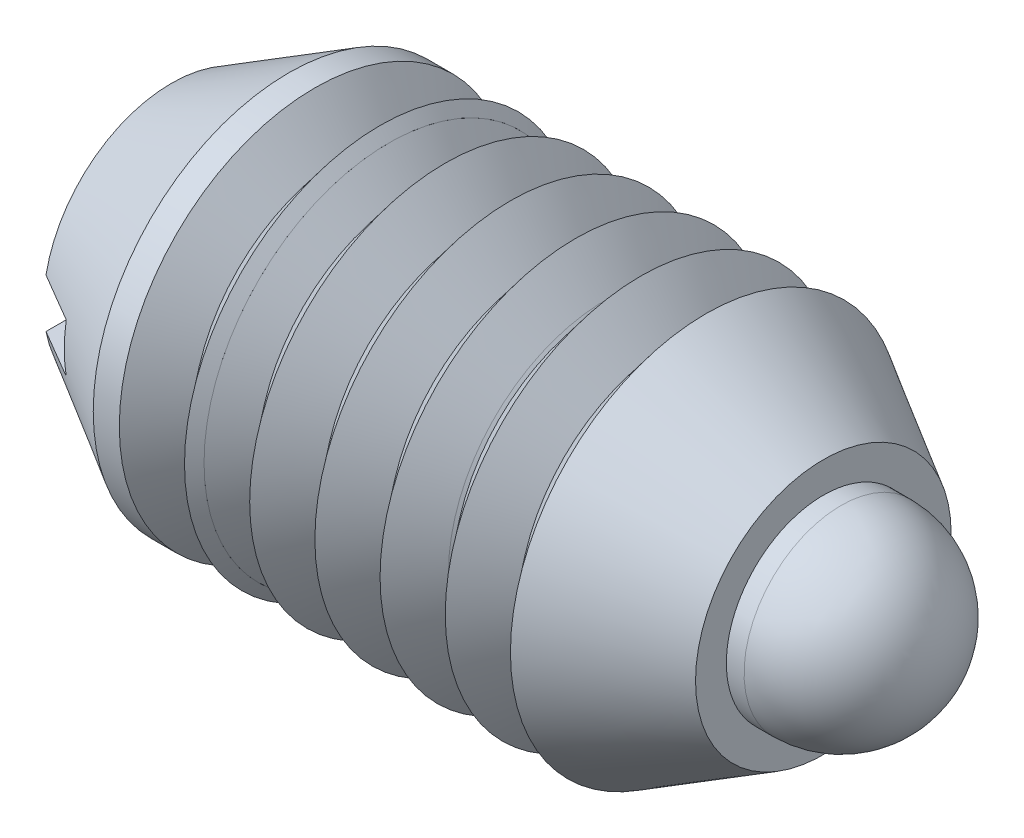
ISO-10303-21;
HEADER;
FILE_DESCRIPTION(('STEP AP214'),'2;1');
FILE_NAME('part.step','',(''),(''),'','','');
FILE_SCHEMA(('AUTOMOTIVE_DESIGN { 1 0 10303 214 1 1 1 1 }'));
ENDSEC;
DATA;
#1=APPLICATION_CONTEXT('core data for automotive mechanical design processes');
#2=APPLICATION_PROTOCOL_DEFINITION('international standard','automotive_design',2000,#1);
#3=PRODUCT_CONTEXT('',#1,'mechanical');
#4=PRODUCT('Part','Part','',(#3));
#5=PRODUCT_RELATED_PRODUCT_CATEGORY('part','',(#4));
#6=PRODUCT_DEFINITION_FORMATION('','',#4);
#7=PRODUCT_DEFINITION_CONTEXT('part definition',#1,'design');
#8=PRODUCT_DEFINITION('design','',#6,#7);
#9=PRODUCT_DEFINITION_SHAPE('','',#8);
#10=(LENGTH_UNIT() NAMED_UNIT(*) SI_UNIT(.MILLI.,.METRE.));
#11=(NAMED_UNIT(*) PLANE_ANGLE_UNIT() SI_UNIT($,.RADIAN.));
#12=(NAMED_UNIT(*) SI_UNIT($,.STERADIAN.) SOLID_ANGLE_UNIT());
#13=UNCERTAINTY_MEASURE_WITH_UNIT(LENGTH_MEASURE(1.E-05),#10,'distance_accuracy_value','');
#14=(GEOMETRIC_REPRESENTATION_CONTEXT(3) GLOBAL_UNCERTAINTY_ASSIGNED_CONTEXT((#13)) GLOBAL_UNIT_ASSIGNED_CONTEXT((#10,
#11,#12)) REPRESENTATION_CONTEXT('',''));
#15=CARTESIAN_POINT('',(0.,0.,0.));
#16=DIRECTION('',(0.,0.,1.));
#17=DIRECTION('',(1.,0.,0.));
#18=AXIS2_PLACEMENT_3D('',#15,#16,#17);
#19=CARTESIAN_POINT('',(10.44194,0.,0.));
#20=DIRECTION('',(-1.,0.,0.));
#21=DIRECTION('',(0.,-0.719424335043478,-0.694570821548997));
#22=AXIS2_PLACEMENT_3D('',#19,#20,#21);
#23=PLANE('',#22);
#24=CARTESIAN_POINT('',(10.44194,0.,0.));
#25=DIRECTION('',(1.,0.,0.));
#26=DIRECTION('',(0.,0.719424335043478,0.694570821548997));
#27=AXIS2_PLACEMENT_3D('',#24,#25,#26);
#28=CIRCLE('',#27,2.3622);
#29=CARTESIAN_POINT('',(10.44194,1.6994241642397,1.64071519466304));
#30=VERTEX_POINT('',#29);
#31=EDGE_CURVE('P0_E10',#30,#30,#28,.T.);
#32=ORIENTED_EDGE('',*,*,#31,.F.);
#33=EDGE_LOOP('',(#32));
#34=FACE_BOUND('',#33,.T.);
#35=ADVANCED_FACE('P0_F14',(#34),#23,.T.);
#36=CARTESIAN_POINT('',(10.91438,0.,0.));
#37=DIRECTION('',(1.,0.,0.));
#38=DIRECTION('',(0.,0.719424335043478,0.694570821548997));
#39=AXIS2_PLACEMENT_3D('',#36,#37,#38);
#40=CONICAL_SURFACE('',#39,2.83464,0.785398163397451);
#41=ORIENTED_EDGE('',*,*,#31,.T.);
#42=EDGE_LOOP('',(#41));
#43=FACE_BOUND('',#42,.T.);
#44=CARTESIAN_POINT('',(10.91438,0.,0.));
#45=DIRECTION('',(1.,0.,0.));
#46=DIRECTION('',(0.,0.719424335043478,0.694570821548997));
#47=AXIS2_PLACEMENT_3D('',#44,#45,#46);
#48=CIRCLE('',#47,2.83464);
#49=CARTESIAN_POINT('',(10.91438,2.03930899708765,1.96885823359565));
#50=VERTEX_POINT('',#49);
#51=EDGE_CURVE('P0_E20',#50,#50,#48,.T.);
#52=ORIENTED_EDGE('',*,*,#51,.F.);
#53=EDGE_LOOP('',(#52));
#54=FACE_BOUND('',#53,.T.);
#55=ADVANCED_FACE('P0_F54',(#43,#54),#40,.T.);
#56=CARTESIAN_POINT('',(18.669,0.,0.));
#57=DIRECTION('',(1.,0.,0.));
#58=DIRECTION('',(0.,0.719424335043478,0.694570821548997));
#59=AXIS2_PLACEMENT_3D('',#56,#57,#58);
#60=CYLINDRICAL_SURFACE('',#59,2.83464);
#61=ORIENTED_EDGE('',*,*,#51,.T.);
#62=EDGE_LOOP('',(#61));
#63=FACE_BOUND('',#62,.T.);
#64=CARTESIAN_POINT('',(14.3480499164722,0.,0.));
#65=DIRECTION('',(1.,0.,0.));
#66=DIRECTION('',(0.,0.719424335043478,0.694570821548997));
#67=AXIS2_PLACEMENT_3D('',#64,#65,#66);
#68=CIRCLE('',#67,2.83464);
#69=CARTESIAN_POINT('',(14.3480499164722,2.03930899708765,1.96885823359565));
#70=VERTEX_POINT('',#69);
#71=EDGE_CURVE('P0_E24',#70,#70,#68,.T.);
#72=ORIENTED_EDGE('',*,*,#71,.F.);
#73=EDGE_LOOP('',(#72));
#74=FACE_BOUND('',#73,.T.);
#75=ADVANCED_FACE('P0_F50',(#63,#74),#60,.T.);
#76=CARTESIAN_POINT('',(15.16634,0.,0.));
#77=DIRECTION('',(-1.,0.,0.));
#78=DIRECTION('',(0.,-0.719424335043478,-0.694570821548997));
#79=AXIS2_PLACEMENT_3D('',#76,#77,#78);
#80=CONICAL_SURFACE('',#79,2.3622,0.5235987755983);
#81=ORIENTED_EDGE('',*,*,#71,.T.);
#82=EDGE_LOOP('',(#81));
#83=FACE_BOUND('',#82,.T.);
#84=CARTESIAN_POINT('',(15.16634,0.,0.));
#85=DIRECTION('',(1.,0.,0.));
#86=DIRECTION('',(0.,0.719424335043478,0.694570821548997));
#87=AXIS2_PLACEMENT_3D('',#84,#85,#86);
#88=CIRCLE('',#87,2.3622);
#89=CARTESIAN_POINT('',(15.16634,1.6994241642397,1.64071519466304));
#90=VERTEX_POINT('',#89);
#91=EDGE_CURVE('P0_E28',#90,#90,#88,.T.);
#92=ORIENTED_EDGE('',*,*,#91,.F.);
#93=EDGE_LOOP('',(#92));
#94=FACE_BOUND('',#93,.T.);
#95=ADVANCED_FACE('P0_F41',(#83,#94),#80,.T.);
#96=CARTESIAN_POINT('',(18.669,0.,0.));
#97=DIRECTION('',(1.,0.,0.));
#98=DIRECTION('',(0.,0.719424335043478,0.694570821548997));
#99=AXIS2_PLACEMENT_3D('',#96,#97,#98);
#100=CYLINDRICAL_SURFACE('',#99,2.3622);
#101=ORIENTED_EDGE('',*,*,#91,.T.);
#102=EDGE_LOOP('',(#101));
#103=FACE_BOUND('',#102,.T.);
#104=CARTESIAN_POINT('',(16.3068,0.,0.));
#105=DIRECTION('',(1.,0.,0.));
#106=DIRECTION('',(0.,0.719424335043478,0.694570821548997));
#107=AXIS2_PLACEMENT_3D('',#104,#105,#106);
#108=CIRCLE('',#107,2.3622);
#109=CARTESIAN_POINT('',(16.3068,1.6994241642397,1.64071519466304));
#110=VERTEX_POINT('',#109);
#111=EDGE_CURVE('P0_E33',#110,#110,#108,.T.);
#112=ORIENTED_EDGE('',*,*,#111,.F.);
#113=EDGE_LOOP('',(#112));
#114=FACE_BOUND('',#113,.T.);
#115=ADVANCED_FACE('P0_F39',(#103,#114),#100,.T.);
#116=CARTESIAN_POINT('',(16.3068,0.,0.));
#117=DIRECTION('',(1.,0.,0.));
#118=DIRECTION('',(0.,0.719424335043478,0.694570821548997));
#119=AXIS2_PLACEMENT_3D('',#116,#117,#118);
#120=SPHERICAL_SURFACE('',#119,2.3622);
#121=ORIENTED_EDGE('',*,*,#111,.T.);
#122=EDGE_LOOP('',(#121));
#123=FACE_BOUND('',#122,.T.);
#124=ADVANCED_FACE('P0_F37',(#123),#120,.T.);
#125=CLOSED_SHELL('',(#35,#55,#75,#95,#115,#124));
#126=MANIFOLD_SOLID_BREP('P0_B1',#125);
#127=CARTESIAN_POINT('',(5.29166666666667,9.525,-4.7625));
#128=DIRECTION('',(-1.,0.,0.));
#129=DIRECTION('',(0.,-1.,0.));
#130=AXIS2_PLACEMENT_3D('',#127,#128,#129);
#131=PLANE('',#130);
#132=CARTESIAN_POINT('',(5.29166666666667,0.,0.));
#133=DIRECTION('',(-1.,0.,0.));
#134=DIRECTION('',(0.,-1.,0.));
#135=AXIS2_PLACEMENT_3D('',#132,#133,#134);
#136=CIRCLE('',#135,4.49812841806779);
#137=CARTESIAN_POINT('',(5.29166666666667,-4.49812841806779,0.));
#138=VERTEX_POINT('',#137);
#139=EDGE_CURVE('P1_E31',#138,#138,#136,.F.);
#140=ORIENTED_EDGE('',*,*,#139,.F.);
#141=EDGE_LOOP('',(#140));
#142=FACE_BOUND('',#141,.T.);
#143=CARTESIAN_POINT('',(5.29166666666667,0.,0.));
#144=DIRECTION('',(1.,0.,0.));
#145=DIRECTION('',(0.,0.,-1.));
#146=AXIS2_PLACEMENT_3D('',#143,#144,#145);
#147=CIRCLE('',#146,2.86004);
#148=CARTESIAN_POINT('',(5.29166666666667,0.,-2.86004));
#149=VERTEX_POINT('',#148);
#150=EDGE_CURVE('P1_E47',#149,#149,#147,.T.);
#151=ORIENTED_EDGE('',*,*,#150,.T.);
#152=EDGE_LOOP('',(#151));
#153=FACE_BOUND('',#152,.T.);
#154=ADVANCED_FACE('P1_F14',(#142,#153),#131,.T.);
#155=CARTESIAN_POINT('',(10.5833333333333,9.525,-4.7625));
#156=DIRECTION('',(1.,0.,0.));
#157=DIRECTION('',(0.,0.,-1.));
#158=AXIS2_PLACEMENT_3D('',#155,#156,#157);
#159=PLANE('',#158);
#160=CARTESIAN_POINT('',(10.5833333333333,0.,0.));
#161=DIRECTION('',(1.,0.,0.));
#162=DIRECTION('',(0.,0.,-1.));
#163=AXIS2_PLACEMENT_3D('',#160,#161,#162);
#164=CIRCLE('',#163,3.83719946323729);
#165=CARTESIAN_POINT('',(10.5833333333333,0.,-3.83719946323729));
#166=VERTEX_POINT('',#165);
#167=EDGE_CURVE('P1_E33',#166,#166,#164,.F.);
#168=ORIENTED_EDGE('',*,*,#167,.F.);
#169=EDGE_LOOP('',(#168));
#170=FACE_BOUND('',#169,.T.);
#171=CARTESIAN_POINT('',(10.5833333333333,0.,0.));
#172=DIRECTION('',(1.,0.,0.));
#173=DIRECTION('',(0.,0.,-1.));
#174=AXIS2_PLACEMENT_3D('',#171,#172,#173);
#175=CIRCLE('',#174,2.86004);
#176=CARTESIAN_POINT('',(10.5833333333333,0.,-2.86004));
#177=VERTEX_POINT('',#176);
#178=EDGE_CURVE('P1_E18',#177,#177,#175,.F.);
#179=ORIENTED_EDGE('',*,*,#178,.T.);
#180=EDGE_LOOP('',(#179));
#181=FACE_BOUND('',#180,.T.);
#182=ADVANCED_FACE('P1_F71',(#170,#181),#159,.T.);
#183=CARTESIAN_POINT('',(8.25499999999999,0.,0.));
#184=DIRECTION('',(-1.,0.,0.));
#185=DIRECTION('',(0.,0.,1.));
#186=AXIS2_PLACEMENT_3D('',#183,#184,#185);
#187=CONICAL_SURFACE('',#186,4.7625,0.895664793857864);
#188=CARTESIAN_POINT('',(9.04874999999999,0.,0.));
#189=DIRECTION('',(-1.,0.,0.));
#190=DIRECTION('',(0.,0.,1.));
#191=AXIS2_PLACEMENT_3D('',#188,#189,#190);
#192=CIRCLE('',#191,3.77110656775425);
#193=CARTESIAN_POINT('',(9.04874999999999,0.,3.77110656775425));
#194=VERTEX_POINT('',#193);
#195=EDGE_CURVE('P1_E10',#194,#194,#192,.T.);
#196=ORIENTED_EDGE('',*,*,#195,.T.);
#197=EDGE_LOOP('',(#196));
#198=FACE_BOUND('',#197,.T.);
#199=CARTESIAN_POINT('',(8.25499999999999,0.,0.));
#200=DIRECTION('',(-1.,0.,0.));
#201=DIRECTION('',(0.,0.,1.));
#202=AXIS2_PLACEMENT_3D('',#199,#200,#201);
#203=CIRCLE('',#202,4.7625);
#204=CARTESIAN_POINT('',(8.25499999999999,0.,4.7625));
#205=VERTEX_POINT('',#204);
#206=EDGE_CURVE('P1_E44',#205,#205,#203,.T.);
#207=ORIENTED_EDGE('',*,*,#206,.F.);
#208=EDGE_LOOP('',(#207));
#209=FACE_BOUND('',#208,.T.);
#210=ADVANCED_FACE('P1_F77',(#198,#209),#187,.T.);
#211=CARTESIAN_POINT('',(9.04874999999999,0.,0.));
#212=DIRECTION('',(1.,0.,0.));
#213=DIRECTION('',(0.,0.,-1.));
#214=AXIS2_PLACEMENT_3D('',#211,#212,#213);
#215=CONICAL_SURFACE('',#214,3.77110656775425,0.895664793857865);
#216=CARTESIAN_POINT('',(9.84249999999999,0.,0.));
#217=DIRECTION('',(-1.,0.,0.));
#218=DIRECTION('',(0.,0.,1.));
#219=AXIS2_PLACEMENT_3D('',#216,#217,#218);
#220=CIRCLE('',#219,4.7625);
#221=CARTESIAN_POINT('',(9.84249999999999,0.,4.7625));
#222=VERTEX_POINT('',#221);
#223=EDGE_CURVE('P1_E22',#222,#222,#220,.T.);
#224=ORIENTED_EDGE('',*,*,#223,.T.);
#225=EDGE_LOOP('',(#224));
#226=FACE_BOUND('',#225,.T.);
#227=ORIENTED_EDGE('',*,*,#195,.F.);
#228=EDGE_LOOP('',(#227));
#229=FACE_BOUND('',#228,.T.);
#230=ADVANCED_FACE('P1_F67',(#226,#229),#215,.T.);
#231=CARTESIAN_POINT('',(9.84249999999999,0.,0.));
#232=DIRECTION('',(-1.,0.,0.));
#233=DIRECTION('',(0.,0.,1.));
#234=AXIS2_PLACEMENT_3D('',#231,#232,#233);
#235=CONICAL_SURFACE('',#234,4.7625,0.895664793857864);
#236=ORIENTED_EDGE('',*,*,#223,.F.);
#237=EDGE_LOOP('',(#236));
#238=FACE_BOUND('',#237,.T.);
#239=ORIENTED_EDGE('',*,*,#167,.T.);
#240=EDGE_LOOP('',(#239));
#241=FACE_BOUND('',#240,.T.);
#242=ADVANCED_FACE('P1_F16',(#238,#241),#235,.T.);
#243=CARTESIAN_POINT('',(7.46124999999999,0.,0.));
#244=DIRECTION('',(1.,0.,0.));
#245=DIRECTION('',(0.,0.,-1.));
#246=AXIS2_PLACEMENT_3D('',#243,#244,#245);
#247=CONICAL_SURFACE('',#246,3.77110656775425,0.895664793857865);
#248=ORIENTED_EDGE('',*,*,#206,.T.);
#249=EDGE_LOOP('',(#248));
#250=FACE_BOUND('',#249,.T.);
#251=CARTESIAN_POINT('',(7.46124999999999,0.,0.));
#252=DIRECTION('',(-1.,0.,0.));
#253=DIRECTION('',(0.,0.,1.));
#254=AXIS2_PLACEMENT_3D('',#251,#252,#253);
#255=CIRCLE('',#254,3.77110656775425);
#256=CARTESIAN_POINT('',(7.46124999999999,0.,3.77110656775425));
#257=VERTEX_POINT('',#256);
#258=EDGE_CURVE('P1_E27',#257,#257,#255,.T.);
#259=ORIENTED_EDGE('',*,*,#258,.F.);
#260=EDGE_LOOP('',(#259));
#261=FACE_BOUND('',#260,.T.);
#262=ADVANCED_FACE('P1_F56',(#250,#261),#247,.T.);
#263=CARTESIAN_POINT('',(6.66749999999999,0.,0.));
#264=DIRECTION('',(-1.,0.,0.));
#265=DIRECTION('',(0.,0.,1.));
#266=AXIS2_PLACEMENT_3D('',#263,#264,#265);
#267=CONICAL_SURFACE('',#266,4.7625,0.895664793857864);
#268=ORIENTED_EDGE('',*,*,#258,.T.);
#269=EDGE_LOOP('',(#268));
#270=FACE_BOUND('',#269,.T.);
#271=CARTESIAN_POINT('',(6.66749999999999,0.,0.));
#272=DIRECTION('',(-1.,0.,0.));
#273=DIRECTION('',(0.,0.,1.));
#274=AXIS2_PLACEMENT_3D('',#271,#272,#273);
#275=CIRCLE('',#274,4.7625);
#276=CARTESIAN_POINT('',(6.66749999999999,0.,4.7625));
#277=VERTEX_POINT('',#276);
#278=EDGE_CURVE('P1_E35',#277,#277,#275,.T.);
#279=ORIENTED_EDGE('',*,*,#278,.F.);
#280=EDGE_LOOP('',(#279));
#281=FACE_BOUND('',#280,.T.);
#282=ADVANCED_FACE('P1_F53',(#270,#281),#267,.T.);
#283=CARTESIAN_POINT('',(5.87374999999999,0.,0.));
#284=DIRECTION('',(1.,0.,0.));
#285=DIRECTION('',(0.,0.,-1.));
#286=AXIS2_PLACEMENT_3D('',#283,#284,#285);
#287=CONICAL_SURFACE('',#286,3.77110656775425,0.895664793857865);
#288=ORIENTED_EDGE('',*,*,#278,.T.);
#289=EDGE_LOOP('',(#288));
#290=FACE_BOUND('',#289,.T.);
#291=CARTESIAN_POINT('',(5.87374999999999,0.,0.));
#292=DIRECTION('',(-1.,0.,0.));
#293=DIRECTION('',(0.,0.,1.));
#294=AXIS2_PLACEMENT_3D('',#291,#292,#293);
#295=CIRCLE('',#294,3.77110656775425);
#296=CARTESIAN_POINT('',(5.87374999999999,0.,3.77110656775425));
#297=VERTEX_POINT('',#296);
#298=EDGE_CURVE('P1_E39',#297,#297,#295,.T.);
#299=ORIENTED_EDGE('',*,*,#298,.F.);
#300=EDGE_LOOP('',(#299));
#301=FACE_BOUND('',#300,.T.);
#302=ADVANCED_FACE('P1_F65',(#290,#301),#287,.T.);
#303=CARTESIAN_POINT('',(5.07999999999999,0.,0.));
#304=DIRECTION('',(-1.,0.,0.));
#305=DIRECTION('',(0.,0.,1.));
#306=AXIS2_PLACEMENT_3D('',#303,#304,#305);
#307=CONICAL_SURFACE('',#306,4.7625,0.895664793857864);
#308=ORIENTED_EDGE('',*,*,#298,.T.);
#309=EDGE_LOOP('',(#308));
#310=FACE_BOUND('',#309,.T.);
#311=ORIENTED_EDGE('',*,*,#139,.T.);
#312=EDGE_LOOP('',(#311));
#313=FACE_BOUND('',#312,.T.);
#314=ADVANCED_FACE('P1_F84',(#310,#313),#307,.T.);
#315=CARTESIAN_POINT('',(15.875,0.,0.));
#316=DIRECTION('',(-1.,0.,0.));
#317=DIRECTION('',(0.,0.,1.));
#318=AXIS2_PLACEMENT_3D('',#315,#316,#317);
#319=CYLINDRICAL_SURFACE('',#318,2.86004);
#320=ORIENTED_EDGE('',*,*,#178,.F.);
#321=EDGE_LOOP('',(#320));
#322=FACE_BOUND('',#321,.T.);
#323=ORIENTED_EDGE('',*,*,#150,.F.);
#324=EDGE_LOOP('',(#323));
#325=FACE_BOUND('',#324,.T.);
#326=ADVANCED_FACE('P1_F87',(#322,#325),#319,.F.);
#327=CLOSED_SHELL('',(#154,#182,#210,#230,#242,#262,#282,#302,#314,#326));
#328=MANIFOLD_SOLID_BREP('P1_B1',#327);
#329=CARTESIAN_POINT('',(15.875,0.,0.));
#330=DIRECTION('',(1.,0.,0.));
#331=DIRECTION('',(0.,0.,-1.));
#332=AXIS2_PLACEMENT_3D('',#329,#330,#331);
#333=PLANE('',#332);
#334=CARTESIAN_POINT('',(15.875,0.,0.));
#335=DIRECTION('',(1.,0.,0.));
#336=DIRECTION('',(0.,0.,-1.));
#337=AXIS2_PLACEMENT_3D('',#334,#335,#336);
#338=CIRCLE('',#337,3.11272160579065);
#339=CARTESIAN_POINT('',(15.875,0.,-3.11272160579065));
#340=VERTEX_POINT('',#339);
#341=EDGE_CURVE('P2_E79',#340,#340,#338,.T.);
#342=ORIENTED_EDGE('',*,*,#341,.T.);
#343=EDGE_LOOP('',(#342));
#344=FACE_BOUND('',#343,.T.);
#345=CARTESIAN_POINT('',(15.875,0.,0.));
#346=DIRECTION('',(-1.,0.,0.));
#347=DIRECTION('',(0.,0.,1.));
#348=AXIS2_PLACEMENT_3D('',#345,#346,#347);
#349=CIRCLE('',#348,2.3622);
#350=CARTESIAN_POINT('',(15.875,0.,2.3622));
#351=VERTEX_POINT('',#350);
#352=EDGE_CURVE('P2_E66',#351,#351,#349,.T.);
#353=ORIENTED_EDGE('',*,*,#352,.T.);
#354=EDGE_LOOP('',(#353));
#355=FACE_BOUND('',#354,.T.);
#356=ADVANCED_FACE('P2_F15',(#344,#355),#333,.T.);
#357=CARTESIAN_POINT('',(15.875,0.,0.));
#358=DIRECTION('',(-1.,0.,0.));
#359=DIRECTION('',(0.,0.,1.));
#360=AXIS2_PLACEMENT_3D('',#357,#358,#359);
#361=CONICAL_SURFACE('',#360,3.11272160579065,0.523598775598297);
#362=CARTESIAN_POINT('',(13.0175,0.,0.));
#363=DIRECTION('',(-1.,0.,0.));
#364=DIRECTION('',(0.,0.,1.));
#365=AXIS2_PLACEMENT_3D('',#362,#363,#364);
#366=CIRCLE('',#365,4.7625);
#367=CARTESIAN_POINT('',(13.0175,0.,4.7625));
#368=VERTEX_POINT('',#367);
#369=EDGE_CURVE('P2_E139',#368,#368,#366,.T.);
#370=ORIENTED_EDGE('',*,*,#369,.F.);
#371=EDGE_LOOP('',(#370));
#372=FACE_BOUND('',#371,.T.);
#373=ORIENTED_EDGE('',*,*,#341,.F.);
#374=EDGE_LOOP('',(#373));
#375=FACE_BOUND('',#374,.T.);
#376=ADVANCED_FACE('P2_F17',(#372,#375),#361,.T.);
#377=CARTESIAN_POINT('',(0.,0.,0.));
#378=DIRECTION('',(-1.,0.,0.));
#379=DIRECTION('',(0.,0.,1.));
#380=AXIS2_PLACEMENT_3D('',#377,#378,#379);
#381=CYLINDRICAL_SURFACE('',#380,2.3622);
#382=CARTESIAN_POINT('',(15.16634,0.,0.));
#383=DIRECTION('',(-1.,0.,0.));
#384=DIRECTION('',(0.,0.,1.));
#385=AXIS2_PLACEMENT_3D('',#382,#383,#384);
#386=CIRCLE('',#385,2.3622);
#387=CARTESIAN_POINT('',(15.16634,0.,2.3622));
#388=VERTEX_POINT('',#387);
#389=EDGE_CURVE('P2_E151',#388,#388,#386,.T.);
#390=ORIENTED_EDGE('',*,*,#389,.T.);
#391=EDGE_LOOP('',(#390));
#392=FACE_BOUND('',#391,.T.);
#393=ORIENTED_EDGE('',*,*,#352,.F.);
#394=EDGE_LOOP('',(#393));
#395=FACE_BOUND('',#394,.T.);
#396=ADVANCED_FACE('P2_F177',(#392,#395),#381,.F.);
#397=CARTESIAN_POINT('',(15.16634,0.,0.));
#398=DIRECTION('',(-1.,0.,0.));
#399=DIRECTION('',(0.,0.,1.));
#400=AXIS2_PLACEMENT_3D('',#397,#398,#399);
#401=CONICAL_SURFACE('',#400,2.3622,0.785398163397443);
#402=CARTESIAN_POINT('',(14.6939,0.,0.));
#403=DIRECTION('',(-1.,0.,0.));
#404=DIRECTION('',(0.,0.,1.));
#405=AXIS2_PLACEMENT_3D('',#402,#403,#404);
#406=CIRCLE('',#405,2.83464);
#407=CARTESIAN_POINT('',(14.6939,0.,2.83464));
#408=VERTEX_POINT('',#407);
#409=EDGE_CURVE('P2_E148',#408,#408,#406,.T.);
#410=ORIENTED_EDGE('',*,*,#409,.T.);
#411=EDGE_LOOP('',(#410));
#412=FACE_BOUND('',#411,.T.);
#413=ORIENTED_EDGE('',*,*,#389,.F.);
#414=EDGE_LOOP('',(#413));
#415=FACE_BOUND('',#414,.T.);
#416=ADVANCED_FACE('P2_F184',(#412,#415),#401,.F.);
#417=CARTESIAN_POINT('',(0.,0.,0.));
#418=DIRECTION('',(-1.,0.,0.));
#419=DIRECTION('',(0.,0.,1.));
#420=AXIS2_PLACEMENT_3D('',#417,#418,#419);
#421=CYLINDRICAL_SURFACE('',#420,2.83464);
#422=CARTESIAN_POINT('',(3.571875,0.,0.));
#423=DIRECTION('',(-1.,0.,0.));
#424=DIRECTION('',(0.,0.,1.));
#425=AXIS2_PLACEMENT_3D('',#422,#423,#424);
#426=CIRCLE('',#425,2.83464);
#427=CARTESIAN_POINT('',(3.571875,0.,2.83464));
#428=VERTEX_POINT('',#427);
#429=EDGE_CURVE('P2_E145',#428,#428,#426,.T.);
#430=ORIENTED_EDGE('',*,*,#429,.T.);
#431=EDGE_LOOP('',(#430));
#432=FACE_BOUND('',#431,.T.);
#433=ORIENTED_EDGE('',*,*,#409,.F.);
#434=EDGE_LOOP('',(#433));
#435=FACE_BOUND('',#434,.T.);
#436=ADVANCED_FACE('P2_F189',(#432,#435),#421,.F.);
#437=CARTESIAN_POINT('',(3.571875,0.,0.));
#438=DIRECTION('',(1.,0.,0.));
#439=DIRECTION('',(0.,0.,-1.));
#440=AXIS2_PLACEMENT_3D('',#437,#438,#439);
#441=PLANE('',#440);
#442=ORIENTED_EDGE('',*,*,#429,.F.);
#443=EDGE_LOOP('',(#442));
#444=FACE_BOUND('',#443,.T.);
#445=ADVANCED_FACE('P2_F195',(#444),#441,.T.);
#446=CARTESIAN_POINT('',(12.22375,0.,0.));
#447=DIRECTION('',(1.,0.,0.));
#448=DIRECTION('',(0.,0.,-1.));
#449=AXIS2_PLACEMENT_3D('',#446,#447,#448);
#450=CONICAL_SURFACE('',#449,3.77110656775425,0.895664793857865);
#451=ORIENTED_EDGE('',*,*,#369,.T.);
#452=EDGE_LOOP('',(#451));
#453=FACE_BOUND('',#452,.T.);
#454=CARTESIAN_POINT('',(12.22375,0.,0.));
#455=DIRECTION('',(-1.,0.,0.));
#456=DIRECTION('',(0.,0.,1.));
#457=AXIS2_PLACEMENT_3D('',#454,#455,#456);
#458=CIRCLE('',#457,3.77110656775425);
#459=CARTESIAN_POINT('',(12.22375,0.,3.77110656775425));
#460=VERTEX_POINT('',#459);
#461=EDGE_CURVE('P2_E142',#460,#460,#458,.T.);
#462=ORIENTED_EDGE('',*,*,#461,.F.);
#463=EDGE_LOOP('',(#462));
#464=FACE_BOUND('',#463,.T.);
#465=ADVANCED_FACE('P2_F199',(#453,#464),#450,.T.);
#466=CARTESIAN_POINT('',(11.43,0.,0.));
#467=DIRECTION('',(-1.,0.,0.));
#468=DIRECTION('',(0.,0.,1.));
#469=AXIS2_PLACEMENT_3D('',#466,#467,#468);
#470=CONICAL_SURFACE('',#469,4.7625,0.895664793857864);
#471=ORIENTED_EDGE('',*,*,#461,.T.);
#472=EDGE_LOOP('',(#471));
#473=FACE_BOUND('',#472,.T.);
#474=CARTESIAN_POINT('',(11.43,0.,0.));
#475=DIRECTION('',(-1.,0.,0.));
#476=DIRECTION('',(0.,0.,1.));
#477=AXIS2_PLACEMENT_3D('',#474,#475,#476);
#478=CIRCLE('',#477,4.7625);
#479=CARTESIAN_POINT('',(11.43,0.,4.7625));
#480=VERTEX_POINT('',#479);
#481=EDGE_CURVE('P2_E133',#480,#480,#478,.T.);
#482=ORIENTED_EDGE('',*,*,#481,.F.);
#483=EDGE_LOOP('',(#482));
#484=FACE_BOUND('',#483,.T.);
#485=ADVANCED_FACE('P2_F203',(#473,#484),#470,.T.);
#486=CARTESIAN_POINT('',(10.63625,0.,0.));
#487=DIRECTION('',(1.,0.,0.));
#488=DIRECTION('',(0.,0.,-1.));
#489=AXIS2_PLACEMENT_3D('',#486,#487,#488);
#490=CONICAL_SURFACE('',#489,3.77110656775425,0.895664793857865);
#491=ORIENTED_EDGE('',*,*,#481,.T.);
#492=EDGE_LOOP('',(#491));
#493=FACE_BOUND('',#492,.T.);
#494=CARTESIAN_POINT('',(10.63625,0.,0.));
#495=DIRECTION('',(-1.,0.,0.));
#496=DIRECTION('',(0.,0.,1.));
#497=AXIS2_PLACEMENT_3D('',#494,#495,#496);
#498=CIRCLE('',#497,3.77110656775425);
#499=CARTESIAN_POINT('',(10.63625,0.,3.77110656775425));
#500=VERTEX_POINT('',#499);
#501=EDGE_CURVE('P2_E136',#500,#500,#498,.T.);
#502=ORIENTED_EDGE('',*,*,#501,.F.);
#503=EDGE_LOOP('',(#502));
#504=FACE_BOUND('',#503,.T.);
#505=ADVANCED_FACE('P2_F207',(#493,#504),#490,.T.);
#506=CARTESIAN_POINT('',(9.84249999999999,0.,0.));
#507=DIRECTION('',(-1.,0.,0.));
#508=DIRECTION('',(0.,0.,1.));
#509=AXIS2_PLACEMENT_3D('',#506,#507,#508);
#510=CONICAL_SURFACE('',#509,4.7625,0.895664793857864);
#511=CARTESIAN_POINT('',(10.5833333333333,0.,0.));
#512=DIRECTION('',(1.,0.,0.));
#513=DIRECTION('',(0.,0.,-1.));
#514=AXIS2_PLACEMENT_3D('',#511,#512,#513);
#515=CIRCLE('',#514,3.83719946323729);
#516=CARTESIAN_POINT('',(10.5833333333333,0.,-3.83719946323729));
#517=VERTEX_POINT('',#516);
#518=EDGE_CURVE('P2_E19',#517,#517,#515,.F.);
#519=ORIENTED_EDGE('',*,*,#518,.F.);
#520=EDGE_LOOP('',(#519));
#521=FACE_BOUND('',#520,.T.);
#522=ORIENTED_EDGE('',*,*,#501,.T.);
#523=EDGE_LOOP('',(#522));
#524=FACE_BOUND('',#523,.T.);
#525=ADVANCED_FACE('P2_F211',(#521,#524),#510,.T.);
#526=CARTESIAN_POINT('',(5.29166666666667,0.,0.));
#527=DIRECTION('',(1.,0.,0.));
#528=DIRECTION('',(0.,0.,-1.));
#529=AXIS2_PLACEMENT_3D('',#526,#527,#528);
#530=PLANE('',#529);
#531=CARTESIAN_POINT('',(5.29166666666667,0.,0.));
#532=DIRECTION('',(1.,0.,0.));
#533=DIRECTION('',(0.,0.,-1.));
#534=AXIS2_PLACEMENT_3D('',#531,#532,#533);
#535=CIRCLE('',#534,4.49812841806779);
#536=CARTESIAN_POINT('',(5.29166666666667,0.,-4.49812841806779));
#537=VERTEX_POINT('',#536);
#538=EDGE_CURVE('P2_E110',#537,#537,#535,.F.);
#539=ORIENTED_EDGE('',*,*,#538,.F.);
#540=EDGE_LOOP('',(#539));
#541=FACE_BOUND('',#540,.T.);
#542=CARTESIAN_POINT('',(5.29166666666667,0.,0.));
#543=DIRECTION('',(1.,0.,0.));
#544=DIRECTION('',(0.,0.,-1.));
#545=AXIS2_PLACEMENT_3D('',#542,#543,#544);
#546=CIRCLE('',#545,2.86004);
#547=CARTESIAN_POINT('',(5.29166666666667,0.,-2.86004));
#548=VERTEX_POINT('',#547);
#549=EDGE_CURVE('P2_E112',#548,#548,#546,.T.);
#550=ORIENTED_EDGE('',*,*,#549,.F.);
#551=EDGE_LOOP('',(#550));
#552=FACE_BOUND('',#551,.T.);
#553=ADVANCED_FACE('P2_F215',(#541,#552),#530,.T.);
#554=CARTESIAN_POINT('',(24.1951388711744,0.,0.));
#555=DIRECTION('',(-1.,0.,0.));
#556=DIRECTION('',(0.,0.,1.));
#557=AXIS2_PLACEMENT_3D('',#554,#555,#556);
#558=CYLINDRICAL_SURFACE('',#557,2.86004);
#559=ORIENTED_EDGE('',*,*,#549,.T.);
#560=EDGE_LOOP('',(#559));
#561=FACE_BOUND('',#560,.T.);
#562=CARTESIAN_POINT('',(10.5833333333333,0.,0.));
#563=DIRECTION('',(1.,0.,0.));
#564=DIRECTION('',(0.,0.,-1.));
#565=AXIS2_PLACEMENT_3D('',#562,#563,#564);
#566=CIRCLE('',#565,2.86004);
#567=CARTESIAN_POINT('',(10.5833333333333,0.,-2.86004));
#568=VERTEX_POINT('',#567);
#569=EDGE_CURVE('P2_E118',#568,#568,#566,.T.);
#570=ORIENTED_EDGE('',*,*,#569,.F.);
#571=EDGE_LOOP('',(#570));
#572=FACE_BOUND('',#571,.T.);
#573=ADVANCED_FACE('P2_F168',(#561,#572),#558,.T.);
#574=CARTESIAN_POINT('',(10.5833333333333,0.,0.));
#575=DIRECTION('',(1.,0.,0.));
#576=DIRECTION('',(0.,0.,-1.));
#577=AXIS2_PLACEMENT_3D('',#574,#575,#576);
#578=PLANE('',#577);
#579=ORIENTED_EDGE('',*,*,#518,.T.);
#580=EDGE_LOOP('',(#579));
#581=FACE_BOUND('',#580,.T.);
#582=ORIENTED_EDGE('',*,*,#569,.T.);
#583=EDGE_LOOP('',(#582));
#584=FACE_BOUND('',#583,.T.);
#585=ADVANCED_FACE('P2_F163',(#581,#584),#578,.F.);
#586=CARTESIAN_POINT('',(0.,0.,0.));
#587=DIRECTION('',(1.,0.,0.));
#588=DIRECTION('',(0.,0.,-1.));
#589=AXIS2_PLACEMENT_3D('',#586,#587,#588);
#590=PLANE('',#589);
#591=CARTESIAN_POINT('',(0.,0.,0.));
#592=DIRECTION('',(1.,0.,0.));
#593=DIRECTION('',(0.,0.,-1.));
#594=AXIS2_PLACEMENT_3D('',#591,#592,#593);
#595=CIRCLE('',#594,3.11272160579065);
#596=CARTESIAN_POINT('',(0.,-0.5953125,-3.05526411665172));
#597=VERTEX_POINT('',#596);
#598=CARTESIAN_POINT('',(0.,-0.5953125,3.05526411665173));
#599=VERTEX_POINT('',#598);
#600=EDGE_CURVE('P2_E75',#597,#599,#595,.F.);
#601=ORIENTED_EDGE('',*,*,#600,.T.);
#602=DIRECTION('',(0.,0.,1.));
#603=VECTOR('',#602,1.);
#604=CARTESIAN_POINT('',(0.,-0.5953125,-4.7625));
#605=LINE('',#604,#603);
#606=EDGE_CURVE('P2_E33',#597,#599,#605,.T.);
#607=ORIENTED_EDGE('',*,*,#606,.F.);
#608=EDGE_LOOP('',(#601,#607));
#609=FACE_BOUND('',#608,.T.);
#610=ADVANCED_FACE('P2_F101',(#609),#590,.F.);
#611=CARTESIAN_POINT('',(0.,-0.5953125,-4.7625));
#612=DIRECTION('',(0.,-1.,0.));
#613=DIRECTION('',(0.,0.,-1.));
#614=AXIS2_PLACEMENT_3D('',#611,#612,#613);
#615=PLANE('',#614);
#616=CARTESIAN_POINT('',(6.95030037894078,-0.5953125,-7.1005675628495));
#617=CARTESIAN_POINT('',(6.6032863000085,-0.5953125,-6.89951311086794));
#618=CARTESIAN_POINT('',(6.25629570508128,-0.5953125,-6.69841809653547));
#619=CARTESIAN_POINT('',(5.56238222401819,-0.5953125,-6.29611043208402));
#620=CARTESIAN_POINT('',(5.21545933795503,-0.5953125,-6.09489778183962));
#621=CARTESIAN_POINT('',(4.52163449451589,-0.5953125,-5.69227915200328));
#622=CARTESIAN_POINT('',(4.1747325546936,-0.5953125,-5.49087314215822));
#623=CARTESIAN_POINT('',(3.48105251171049,-0.5953125,-5.08784863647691));
#624=CARTESIAN_POINT('',(3.13427440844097,-0.5953125,-4.88623014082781));
#625=CARTESIAN_POINT('',(2.44993548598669,-0.5953125,-4.48794937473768));
#626=CARTESIAN_POINT('',(2.11237010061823,-0.5953125,-4.29129495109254));
#627=CARTESIAN_POINT('',(1.43748846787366,-0.5953125,-3.89755677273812));
#628=CARTESIAN_POINT('',(1.10017222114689,-0.5953125,-3.7004730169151));
#629=CARTESIAN_POINT('',(0.425997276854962,-0.5953125,-3.30565694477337));
#630=CARTESIAN_POINT('',(0.0891385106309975,-0.5953125,-3.10792474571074));
#631=CARTESIAN_POINT('',(-0.583902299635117,-0.5953125,-2.71131332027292));
#632=CARTESIAN_POINT('',(-0.920084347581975,-0.5953125,-2.51243410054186));
#633=CARTESIAN_POINT('',(-1.42425686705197,-0.5953125,-2.21184727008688));
#634=CARTESIAN_POINT('',(-1.59275690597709,-0.5953125,-2.11099555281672));
#635=CARTESIAN_POINT('',(-1.92927626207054,-0.5953125,-1.90836335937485));
#636=CARTESIAN_POINT('',(-2.09729539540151,-0.5953125,-1.80658257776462));
#637=CARTESIAN_POINT('',(-2.4342119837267,-0.5953125,-1.60055194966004));
#638=CARTESIAN_POINT('',(-2.6031005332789,-0.5953125,-1.49628745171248));
#639=CARTESIAN_POINT('',(-2.85513070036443,-0.5953125,-1.33799461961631));
#640=CARTESIAN_POINT('',(-2.93888336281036,-0.5953125,-1.28494050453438));
#641=CARTESIAN_POINT('',(-3.10579445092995,-0.5953125,-1.17790920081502));
#642=CARTESIAN_POINT('',(-3.18895290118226,-0.5953125,-1.12393205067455));
#643=CARTESIAN_POINT('',(-3.35444558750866,-0.5953125,-1.01457407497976));
#644=CARTESIAN_POINT('',(-3.43677905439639,-0.5953125,-0.959192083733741));
#645=CARTESIAN_POINT('',(-3.60023936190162,-0.5953125,-0.846169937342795));
#646=CARTESIAN_POINT('',(-3.68136227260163,-0.5953125,-0.788524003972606));
#647=CARTESIAN_POINT('',(-3.80062582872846,-0.5953125,-0.699609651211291));
#648=CARTESIAN_POINT('',(-3.83978898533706,-0.5953125,-0.669717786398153));
#649=CARTESIAN_POINT('',(-3.91713709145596,-0.5953125,-0.608699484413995));
#650=CARTESIAN_POINT('',(-3.95532226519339,-0.5953125,-0.577573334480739));
#651=CARTESIAN_POINT('',(-4.03005513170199,-0.5953125,-0.513713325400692));
#652=CARTESIAN_POINT('',(-4.06660901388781,-0.5953125,-0.480986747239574));
#653=CARTESIAN_POINT('',(-4.1372977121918,-0.5953125,-0.413038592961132));
#654=CARTESIAN_POINT('',(-4.17143639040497,-0.5953125,-0.377821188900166));
#655=CARTESIAN_POINT('',(-4.21484326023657,-0.5953125,-0.327346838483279));
#656=CARTESIAN_POINT('',(-4.22603371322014,-0.5953125,-0.313755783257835));
#657=CARTESIAN_POINT('',(-4.24767015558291,-0.5953125,-0.285990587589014));
#658=CARTESIAN_POINT('',(-4.25811579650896,-0.5953125,-0.271816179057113));
#659=CARTESIAN_POINT('',(-4.28796639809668,-0.5953125,-0.228385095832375));
#660=CARTESIAN_POINT('',(-4.30599084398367,-0.5953125,-0.198103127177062));
#661=CARTESIAN_POINT('',(-4.32992762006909,-0.5953125,-0.146713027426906));
#662=CARTESIAN_POINT('',(-4.33783306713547,-0.5953125,-0.126548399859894));
#663=CARTESIAN_POINT('',(-4.35036452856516,-0.5953125,-0.0852127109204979));
#664=CARTESIAN_POINT('',(-4.3549949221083,-0.5953125,-0.0640430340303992));
#665=CARTESIAN_POINT('',(-4.36031144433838,-0.5953125,-0.0210056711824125));
#666=CARTESIAN_POINT('',(-4.36096337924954,-0.5953125,0.000866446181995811));
#667=CARTESIAN_POINT('',(-4.35811215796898,-0.5953125,0.0443320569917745));
#668=CARTESIAN_POINT('',(-4.3546071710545,-0.5953125,0.0659254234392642));
#669=CARTESIAN_POINT('',(-4.34291129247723,-0.5953125,0.112613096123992));
#670=CARTESIAN_POINT('',(-4.3338924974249,-0.5953125,0.137493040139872));
#671=CARTESIAN_POINT('',(-4.31210728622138,-0.5953125,0.185556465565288));
#672=CARTESIAN_POINT('',(-4.29932953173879,-0.5953125,0.208734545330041));
#673=CARTESIAN_POINT('',(-4.26712767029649,-0.5953125,0.260114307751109));
#674=CARTESIAN_POINT('',(-4.24685576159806,-0.5953125,0.287772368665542));
#675=CARTESIAN_POINT('',(-4.20375799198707,-0.5953125,0.34105036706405));
#676=CARTESIAN_POINT('',(-4.18092653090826,-0.5953125,0.366665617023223));
#677=CARTESIAN_POINT('',(-4.13348485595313,-0.5953125,0.416511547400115));
#678=CARTESIAN_POINT('',(-4.10886344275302,-0.5953125,0.440731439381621));
#679=CARTESIAN_POINT('',(-4.0585489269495,-0.5953125,0.487960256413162));
#680=CARTESIAN_POINT('',(-4.03285704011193,-0.5953125,0.510970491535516));
#681=CARTESIAN_POINT('',(-3.97783091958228,-0.5953125,0.558571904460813));
#682=CARTESIAN_POINT('',(-3.94840684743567,-0.5953125,0.583058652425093));
#683=CARTESIAN_POINT('',(-3.8888766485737,-0.5953125,0.631191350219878));
#684=CARTESIAN_POINT('',(-3.85877042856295,-0.5953125,0.654837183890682));
#685=CARTESIAN_POINT('',(-3.76767869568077,-0.5953125,0.724827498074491));
#686=CARTESIAN_POINT('',(-3.70594879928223,-0.5953125,0.77020074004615));
#687=CARTESIAN_POINT('',(-3.58119958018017,-0.5953125,0.85939064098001));
#688=CARTESIAN_POINT('',(-3.51817788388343,-0.5953125,0.903203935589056));
#689=CARTESIAN_POINT('',(-3.39138262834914,-0.5953125,0.9896859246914));
#690=CARTESIAN_POINT('',(-3.32760929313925,-0.5953125,1.03235494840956));
#691=CARTESIAN_POINT('',(-3.19966809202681,-0.5953125,1.11679778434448));
#692=CARTESIAN_POINT('',(-3.13550134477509,-0.5953125,1.15857329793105));
#693=CARTESIAN_POINT('',(-3.00677965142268,-0.5953125,1.24153113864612));
#694=CARTESIAN_POINT('',(-2.94222467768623,-0.5953125,1.28271342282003));
#695=CARTESIAN_POINT('',(-2.74829322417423,-0.5953125,1.40548817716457));
#696=CARTESIAN_POINT('',(-2.61849325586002,-0.5953125,1.48641098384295));
#697=CARTESIAN_POINT('',(-2.35898192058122,-0.5953125,1.64668368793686));
#698=CARTESIAN_POINT('',(-2.22927451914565,-0.5953125,1.72604003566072));
#699=CARTESIAN_POINT('',(-1.96941282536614,-0.5953125,1.88401833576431));
#700=CARTESIAN_POINT('',(-1.83925853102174,-0.5953125,1.96264028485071));
#701=CARTESIAN_POINT('',(-1.44833283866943,-0.5953125,2.19775500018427));
#702=CARTESIAN_POINT('',(-1.18710709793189,-0.5953125,2.35349145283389));
#703=CARTESIAN_POINT('',(-0.663876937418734,-0.5953125,2.6639543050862));
#704=CARTESIAN_POINT('',(-0.401872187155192,-0.5953125,2.81868014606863));
#705=CARTESIAN_POINT('',(0.122530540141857,-0.5953125,3.12745407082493));
#706=CARTESIAN_POINT('',(0.384928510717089,-0.5953125,3.28150216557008));
#707=CARTESIAN_POINT('',(0.909819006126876,-0.5953125,3.58906313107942));
#708=CARTESIAN_POINT('',(1.17231137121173,-0.5953125,3.7425762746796));
#709=CARTESIAN_POINT('',(1.69747533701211,-0.5953125,4.04929816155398));
#710=CARTESIAN_POINT('',(1.96014693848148,-0.5953125,4.20250690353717));
#711=CARTESIAN_POINT('',(2.74827094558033,-0.5953125,4.66176450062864));
#712=CARTESIAN_POINT('',(3.27391129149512,-0.5953125,4.96749078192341));
#713=CARTESIAN_POINT('',(4.06209764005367,-0.5953125,5.42543726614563));
#714=CARTESIAN_POINT('',(4.32453853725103,-0.5953125,5.57783851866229));
#715=CARTESIAN_POINT('',(4.84948661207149,-0.5953125,5.88254927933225));
#716=CARTESIAN_POINT('',(5.11199379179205,-0.5953125,6.03485878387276));
#717=CARTESIAN_POINT('',(5.63711856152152,-0.5953125,6.33943977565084));
#718=CARTESIAN_POINT('',(5.89973616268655,-0.5953125,6.49171124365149));
#719=CARTESIAN_POINT('',(6.42499790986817,-0.5953125,6.79618582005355));
#720=CARTESIAN_POINT('',(6.68764205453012,-0.5953125,6.94838893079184));
#721=CARTESIAN_POINT('',(6.95030037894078,-0.5953125,7.1005675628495));
#722=B_SPLINE_CURVE_WITH_KNOTS('',3,(#616,#617,#618,#619,#620,#621,#622,#623,#624,#625,#626,
#627,#628,#629,#630,#631,#632,#633,#634,#635,#636,#637,#638,#639,#640,#641,#642,#643,#644,#645,
#646,#647,#648,#649,#650,#651,#652,#653,#654,#655,#656,#657,#658,#659,#660,#661,#662,#663,#664,
#665,#666,#667,#668,#669,#670,#671,#672,#673,#674,#675,#676,#677,#678,#679,#680,#681,#682,#683,
#684,#685,#686,#687,#688,#689,#690,#691,#692,#693,#694,#695,#696,#697,#698,#699,#700,#701,#702,
#703,#704,#705,#706,#707,#708,#709,#710,#711,#712,#713,#714,#715,#716,#717,#718,#719,#720,#721),
.UNSPECIFIED.,.F.,.F.,(4,2,2,2,2,2,2,2,2,2,2,2,2,2,2,2,2,2,2,2,2,2,2,2,2,2,2,2,2,2,2,2,2,2,2,2,
2,2,2,2,2,2,2,2,2,2,2,2,2,2,2,2,4),(0.,1.20315211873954,2.40630552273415,3.60969569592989,
4.81308481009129,5.98509580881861,7.15710985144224,8.32892251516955,9.50072839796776,
10.089852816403,10.6791784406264,11.27460300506,11.572027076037,11.8694387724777,
12.1671058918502,12.4655896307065,12.6133761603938,12.7611284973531,12.9082618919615,
13.0551544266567,13.1079449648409,13.1607600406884,13.2659181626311,13.3306881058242,
13.3953712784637,13.4606096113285,13.5258766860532,13.6048180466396,13.6840000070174,
13.7866183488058,13.889465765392,13.9930237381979,14.0964671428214,14.2112866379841,
14.3261219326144,14.5559047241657,14.7861562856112,15.0163408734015,15.2460389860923,
15.4757536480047,15.9346207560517,16.390790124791,16.846961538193,17.7593341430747,
18.67217438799,19.5849998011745,20.497258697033,21.4095214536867,23.2337733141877,
24.1442195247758,25.054699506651,25.9654088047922,26.8760841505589),.UNSPECIFIED.);
#723=CARTESIAN_POINT('',(1.190625,-0.5953125,-3.75321002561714));
#724=VERTEX_POINT('',#723);
#725=EDGE_CURVE('P2_E92',#724,#597,#722,.T.);
#726=ORIENTED_EDGE('',*,*,#725,.T.);
#727=ORIENTED_EDGE('',*,*,#606,.T.);
#728=CARTESIAN_POINT('',(1.190625,-0.5953125,3.75321002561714));
#729=VERTEX_POINT('',#728);
#730=EDGE_CURVE('P2_E86',#599,#729,#722,.T.);
#731=ORIENTED_EDGE('',*,*,#730,.T.);
#732=DIRECTION('',(0.,0.,1.));
#733=VECTOR('',#732,1.);
#734=CARTESIAN_POINT('',(1.190625,-0.5953125,-4.7625));
#735=LINE('',#734,#733);
#736=EDGE_CURVE('P2_E157',#724,#729,#735,.T.);
#737=ORIENTED_EDGE('',*,*,#736,.F.);
#738=EDGE_LOOP('',(#726,#727,#731,#737));
#739=FACE_BOUND('',#738,.T.);
#740=ADVANCED_FACE('P2_F95',(#739),#615,.F.);
#741=CARTESIAN_POINT('',(1.190625,0.5953125,-4.7625));
#742=DIRECTION('',(1.,0.,0.));
#743=DIRECTION('',(0.,0.,-1.));
#744=AXIS2_PLACEMENT_3D('',#741,#742,#743);
#745=PLANE('',#744);
#746=CARTESIAN_POINT('',(1.190625,0.,0.));
#747=DIRECTION('',(1.,0.,0.));
#748=DIRECTION('',(0.,0.,-1.));
#749=AXIS2_PLACEMENT_3D('',#746,#747,#748);
#750=CIRCLE('',#749,3.80012927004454);
#751=CARTESIAN_POINT('',(1.190625,0.5953125,3.75321002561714));
#752=VERTEX_POINT('',#751);
#753=EDGE_CURVE('P2_E41',#729,#752,#750,.F.);
#754=ORIENTED_EDGE('',*,*,#753,.T.);
#755=DIRECTION('',(0.,0.,1.));
#756=VECTOR('',#755,1.);
#757=CARTESIAN_POINT('',(1.190625,0.5953125,-4.7625));
#758=LINE('',#757,#756);
#759=CARTESIAN_POINT('',(1.190625,0.5953125,-3.75321002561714));
#760=VERTEX_POINT('',#759);
#761=EDGE_CURVE('P2_E81',#760,#752,#758,.T.);
#762=ORIENTED_EDGE('',*,*,#761,.F.);
#763=EDGE_CURVE('P2_E24',#760,#724,#750,.F.);
#764=ORIENTED_EDGE('',*,*,#763,.T.);
#765=ORIENTED_EDGE('',*,*,#736,.T.);
#766=EDGE_LOOP('',(#754,#762,#764,#765));
#767=FACE_BOUND('',#766,.T.);
#768=ADVANCED_FACE('P2_F100',(#767),#745,.F.);
#769=CARTESIAN_POINT('',(0.,0.5953125,3.05526411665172));
#770=VERTEX_POINT('',#769);
#771=CARTESIAN_POINT('',(0.,0.5953125,-3.05526411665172));
#772=VERTEX_POINT('',#771);
#773=EDGE_CURVE('P2_E72',#770,#772,#595,.F.);
#774=ORIENTED_EDGE('',*,*,#773,.T.);
#775=DIRECTION('',(0.,0.,1.));
#776=VECTOR('',#775,1.);
#777=CARTESIAN_POINT('',(0.,0.5953125,-4.7625));
#778=LINE('',#777,#776);
#779=EDGE_CURVE('P2_E59',#772,#770,#778,.T.);
#780=ORIENTED_EDGE('',*,*,#779,.T.);
#781=EDGE_LOOP('',(#774,#780));
#782=FACE_BOUND('',#781,.T.);
#783=ADVANCED_FACE('P2_F74',(#782),#590,.F.);
#784=CARTESIAN_POINT('',(0.,0.5953125,-4.7625));
#785=DIRECTION('',(0.,1.,0.));
#786=DIRECTION('',(0.,0.,1.));
#787=AXIS2_PLACEMENT_3D('',#784,#785,#786);
#788=PLANE('',#787);
#789=CARTESIAN_POINT('',(6.95030037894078,0.5953125,7.1005675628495));
#790=CARTESIAN_POINT('',(6.6032863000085,0.5953125,6.89951311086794));
#791=CARTESIAN_POINT('',(6.25629570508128,0.5953125,6.69841809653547));
#792=CARTESIAN_POINT('',(5.56238222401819,0.5953125,6.29611043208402));
#793=CARTESIAN_POINT('',(5.21545933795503,0.5953125,6.09489778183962));
#794=CARTESIAN_POINT('',(4.52163449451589,0.5953125,5.69227915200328));
#795=CARTESIAN_POINT('',(4.1747325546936,0.5953125,5.49087314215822));
#796=CARTESIAN_POINT('',(3.48105251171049,0.5953125,5.08784863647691));
#797=CARTESIAN_POINT('',(3.13427440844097,0.5953125,4.88623014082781));
#798=CARTESIAN_POINT('',(2.44993548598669,0.5953125,4.48794937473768));
#799=CARTESIAN_POINT('',(2.11237010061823,0.5953125,4.29129495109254));
#800=CARTESIAN_POINT('',(1.43748846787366,0.5953125,3.89755677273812));
#801=CARTESIAN_POINT('',(1.10017222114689,0.5953125,3.7004730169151));
#802=CARTESIAN_POINT('',(0.425997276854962,0.5953125,3.30565694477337));
#803=CARTESIAN_POINT('',(0.0891385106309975,0.5953125,3.10792474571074));
#804=CARTESIAN_POINT('',(-0.583902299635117,0.5953125,2.71131332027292));
#805=CARTESIAN_POINT('',(-0.920084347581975,0.5953125,2.51243410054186));
#806=CARTESIAN_POINT('',(-1.42425686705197,0.5953125,2.21184727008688));
#807=CARTESIAN_POINT('',(-1.59275690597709,0.5953125,2.11099555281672));
#808=CARTESIAN_POINT('',(-1.92927626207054,0.5953125,1.90836335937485));
#809=CARTESIAN_POINT('',(-2.09729539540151,0.5953125,1.80658257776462));
#810=CARTESIAN_POINT('',(-2.4342119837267,0.5953125,1.60055194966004));
#811=CARTESIAN_POINT('',(-2.6031005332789,0.5953125,1.49628745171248));
#812=CARTESIAN_POINT('',(-2.85513070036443,0.5953125,1.33799461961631));
#813=CARTESIAN_POINT('',(-2.93888336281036,0.5953125,1.28494050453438));
#814=CARTESIAN_POINT('',(-3.10579445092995,0.5953125,1.17790920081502));
#815=CARTESIAN_POINT('',(-3.18895290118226,0.5953125,1.12393205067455));
#816=CARTESIAN_POINT('',(-3.35444558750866,0.5953125,1.01457407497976));
#817=CARTESIAN_POINT('',(-3.43677905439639,0.5953125,0.959192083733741));
#818=CARTESIAN_POINT('',(-3.60023936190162,0.5953125,0.846169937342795));
#819=CARTESIAN_POINT('',(-3.68136227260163,0.5953125,0.788524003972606));
#820=CARTESIAN_POINT('',(-3.80062582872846,0.5953125,0.699609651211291));
#821=CARTESIAN_POINT('',(-3.83978898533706,0.5953125,0.669717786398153));
#822=CARTESIAN_POINT('',(-3.91713709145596,0.5953125,0.608699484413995));
#823=CARTESIAN_POINT('',(-3.95532226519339,0.5953125,0.577573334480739));
#824=CARTESIAN_POINT('',(-4.03005513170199,0.5953125,0.513713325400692));
#825=CARTESIAN_POINT('',(-4.06660901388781,0.5953125,0.480986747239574));
#826=CARTESIAN_POINT('',(-4.1372977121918,0.5953125,0.413038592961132));
#827=CARTESIAN_POINT('',(-4.17143639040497,0.5953125,0.377821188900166));
#828=CARTESIAN_POINT('',(-4.21484326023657,0.5953125,0.327346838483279));
#829=CARTESIAN_POINT('',(-4.22603371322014,0.5953125,0.313755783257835));
#830=CARTESIAN_POINT('',(-4.24767015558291,0.5953125,0.285990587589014));
#831=CARTESIAN_POINT('',(-4.25811579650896,0.5953125,0.271816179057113));
#832=CARTESIAN_POINT('',(-4.28796639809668,0.5953125,0.228385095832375));
#833=CARTESIAN_POINT('',(-4.30599084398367,0.5953125,0.198103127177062));
#834=CARTESIAN_POINT('',(-4.32992762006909,0.5953125,0.146713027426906));
#835=CARTESIAN_POINT('',(-4.33783306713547,0.5953125,0.126548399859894));
#836=CARTESIAN_POINT('',(-4.35036452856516,0.5953125,0.0852127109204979));
#837=CARTESIAN_POINT('',(-4.3549949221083,0.5953125,0.0640430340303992));
#838=CARTESIAN_POINT('',(-4.36031144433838,0.5953125,0.0210056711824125));
#839=CARTESIAN_POINT('',(-4.36096337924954,0.5953125,-0.000866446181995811));
#840=CARTESIAN_POINT('',(-4.35811215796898,0.5953125,-0.0443320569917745));
#841=CARTESIAN_POINT('',(-4.3546071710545,0.5953125,-0.0659254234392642));
#842=CARTESIAN_POINT('',(-4.34291129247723,0.5953125,-0.112613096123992));
#843=CARTESIAN_POINT('',(-4.3338924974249,0.5953125,-0.137493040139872));
#844=CARTESIAN_POINT('',(-4.31210728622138,0.5953125,-0.185556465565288));
#845=CARTESIAN_POINT('',(-4.29932953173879,0.5953125,-0.208734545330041));
#846=CARTESIAN_POINT('',(-4.26712767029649,0.5953125,-0.260114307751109));
#847=CARTESIAN_POINT('',(-4.24685576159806,0.5953125,-0.287772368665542));
#848=CARTESIAN_POINT('',(-4.20375799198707,0.5953125,-0.34105036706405));
#849=CARTESIAN_POINT('',(-4.18092653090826,0.5953125,-0.366665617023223));
#850=CARTESIAN_POINT('',(-4.13348485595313,0.5953125,-0.416511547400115));
#851=CARTESIAN_POINT('',(-4.10886344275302,0.5953125,-0.440731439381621));
#852=CARTESIAN_POINT('',(-4.0585489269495,0.5953125,-0.487960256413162));
#853=CARTESIAN_POINT('',(-4.03285704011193,0.5953125,-0.510970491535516));
#854=CARTESIAN_POINT('',(-3.97783091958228,0.5953125,-0.558571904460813));
#855=CARTESIAN_POINT('',(-3.94840684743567,0.5953125,-0.583058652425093));
#856=CARTESIAN_POINT('',(-3.8888766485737,0.5953125,-0.631191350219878));
#857=CARTESIAN_POINT('',(-3.85877042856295,0.5953125,-0.654837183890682));
#858=CARTESIAN_POINT('',(-3.76767869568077,0.5953125,-0.724827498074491));
#859=CARTESIAN_POINT('',(-3.70594879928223,0.5953125,-0.77020074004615));
#860=CARTESIAN_POINT('',(-3.58119958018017,0.5953125,-0.85939064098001));
#861=CARTESIAN_POINT('',(-3.51817788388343,0.5953125,-0.903203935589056));
#862=CARTESIAN_POINT('',(-3.39138262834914,0.5953125,-0.9896859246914));
#863=CARTESIAN_POINT('',(-3.32760929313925,0.5953125,-1.03235494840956));
#864=CARTESIAN_POINT('',(-3.19966809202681,0.5953125,-1.11679778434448));
#865=CARTESIAN_POINT('',(-3.13550134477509,0.5953125,-1.15857329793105));
#866=CARTESIAN_POINT('',(-3.00677965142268,0.5953125,-1.24153113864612));
#867=CARTESIAN_POINT('',(-2.94222467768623,0.5953125,-1.28271342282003));
#868=CARTESIAN_POINT('',(-2.74829322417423,0.5953125,-1.40548817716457));
#869=CARTESIAN_POINT('',(-2.61849325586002,0.5953125,-1.48641098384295));
#870=CARTESIAN_POINT('',(-2.35898192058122,0.5953125,-1.64668368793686));
#871=CARTESIAN_POINT('',(-2.22927451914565,0.5953125,-1.72604003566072));
#872=CARTESIAN_POINT('',(-1.96941282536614,0.5953125,-1.88401833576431));
#873=CARTESIAN_POINT('',(-1.83925853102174,0.5953125,-1.96264028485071));
#874=CARTESIAN_POINT('',(-1.44833283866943,0.5953125,-2.19775500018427));
#875=CARTESIAN_POINT('',(-1.18710709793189,0.5953125,-2.35349145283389));
#876=CARTESIAN_POINT('',(-0.663876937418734,0.5953125,-2.6639543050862));
#877=CARTESIAN_POINT('',(-0.401872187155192,0.5953125,-2.81868014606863));
#878=CARTESIAN_POINT('',(0.122530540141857,0.5953125,-3.12745407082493));
#879=CARTESIAN_POINT('',(0.384928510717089,0.5953125,-3.28150216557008));
#880=CARTESIAN_POINT('',(0.909819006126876,0.5953125,-3.58906313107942));
#881=CARTESIAN_POINT('',(1.17231137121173,0.5953125,-3.7425762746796));
#882=CARTESIAN_POINT('',(1.69747533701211,0.5953125,-4.04929816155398));
#883=CARTESIAN_POINT('',(1.96014693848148,0.5953125,-4.20250690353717));
#884=CARTESIAN_POINT('',(2.74827094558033,0.5953125,-4.66176450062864));
#885=CARTESIAN_POINT('',(3.27391129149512,0.5953125,-4.96749078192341));
#886=CARTESIAN_POINT('',(4.06209764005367,0.5953125,-5.42543726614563));
#887=CARTESIAN_POINT('',(4.32453853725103,0.5953125,-5.57783851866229));
#888=CARTESIAN_POINT('',(4.84948661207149,0.5953125,-5.88254927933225));
#889=CARTESIAN_POINT('',(5.11199379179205,0.5953125,-6.03485878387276));
#890=CARTESIAN_POINT('',(5.63711856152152,0.5953125,-6.33943977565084));
#891=CARTESIAN_POINT('',(5.89973616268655,0.5953125,-6.49171124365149));
#892=CARTESIAN_POINT('',(6.42499790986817,0.5953125,-6.79618582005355));
#893=CARTESIAN_POINT('',(6.68764205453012,0.5953125,-6.94838893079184));
#894=CARTESIAN_POINT('',(6.95030037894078,0.5953125,-7.1005675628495));
#895=B_SPLINE_CURVE_WITH_KNOTS('',3,(#789,#790,#791,#792,#793,#794,#795,#796,#797,#798,#799,
#800,#801,#802,#803,#804,#805,#806,#807,#808,#809,#810,#811,#812,#813,#814,#815,#816,#817,#818,
#819,#820,#821,#822,#823,#824,#825,#826,#827,#828,#829,#830,#831,#832,#833,#834,#835,#836,#837,
#838,#839,#840,#841,#842,#843,#844,#845,#846,#847,#848,#849,#850,#851,#852,#853,#854,#855,#856,
#857,#858,#859,#860,#861,#862,#863,#864,#865,#866,#867,#868,#869,#870,#871,#872,#873,#874,#875,
#876,#877,#878,#879,#880,#881,#882,#883,#884,#885,#886,#887,#888,#889,#890,#891,#892,#893,#894),
.UNSPECIFIED.,.F.,.F.,(4,2,2,2,2,2,2,2,2,2,2,2,2,2,2,2,2,2,2,2,2,2,2,2,2,2,2,2,2,2,2,2,2,2,2,2,
2,2,2,2,2,2,2,2,2,2,2,2,2,2,2,2,4),(0.,1.20315211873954,2.40630552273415,3.60969569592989,
4.81308481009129,5.98509580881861,7.15710985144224,8.32892251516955,9.50072839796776,
10.089852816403,10.6791784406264,11.27460300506,11.572027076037,11.8694387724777,
12.1671058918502,12.4655896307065,12.6133761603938,12.7611284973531,12.9082618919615,
13.0551544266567,13.1079449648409,13.1607600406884,13.2659181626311,13.3306881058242,
13.3953712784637,13.4606096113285,13.5258766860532,13.6048180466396,13.6840000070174,
13.7866183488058,13.889465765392,13.9930237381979,14.0964671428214,14.2112866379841,
14.3261219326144,14.5559047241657,14.7861562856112,15.0163408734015,15.2460389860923,
15.4757536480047,15.9346207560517,16.390790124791,16.846961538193,17.7593341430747,
18.67217438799,19.5849998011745,20.497258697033,21.4095214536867,23.2337733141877,
24.1442195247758,25.054699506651,25.9654088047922,26.8760841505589),.UNSPECIFIED.);
#896=EDGE_CURVE('P2_E26',#752,#770,#895,.T.);
#897=ORIENTED_EDGE('',*,*,#896,.T.);
#898=ORIENTED_EDGE('',*,*,#779,.F.);
#899=EDGE_CURVE('P2_E10',#772,#760,#895,.T.);
#900=ORIENTED_EDGE('',*,*,#899,.T.);
#901=ORIENTED_EDGE('',*,*,#761,.T.);
#902=EDGE_LOOP('',(#897,#898,#900,#901));
#903=FACE_BOUND('',#902,.T.);
#904=ADVANCED_FACE('P2_F61',(#903),#788,.F.);
#905=CARTESIAN_POINT('',(2.85750000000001,0.,0.));
#906=DIRECTION('',(1.,0.,0.));
#907=DIRECTION('',(0.,0.,-1.));
#908=AXIS2_PLACEMENT_3D('',#905,#906,#907);
#909=CONICAL_SURFACE('',#908,4.7625,0.523598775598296);
#910=ORIENTED_EDGE('',*,*,#899,.F.);
#911=ORIENTED_EDGE('',*,*,#773,.F.);
#912=ORIENTED_EDGE('',*,*,#896,.F.);
#913=ORIENTED_EDGE('',*,*,#753,.F.);
#914=ORIENTED_EDGE('',*,*,#730,.F.);
#915=ORIENTED_EDGE('',*,*,#600,.F.);
#916=ORIENTED_EDGE('',*,*,#725,.F.);
#917=ORIENTED_EDGE('',*,*,#763,.F.);
#918=EDGE_LOOP('',(#910,#911,#912,#913,#914,#915,#916,#917));
#919=FACE_BOUND('',#918,.T.);
#920=CARTESIAN_POINT('',(2.85750000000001,0.,0.));
#921=DIRECTION('',(1.,0.,0.));
#922=DIRECTION('',(0.,0.,-1.));
#923=AXIS2_PLACEMENT_3D('',#920,#921,#922);
#924=CIRCLE('',#923,4.7625);
#925=CARTESIAN_POINT('',(2.85750000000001,0.,-4.7625));
#926=VERTEX_POINT('',#925);
#927=EDGE_CURVE('P2_E76',#926,#926,#924,.T.);
#928=ORIENTED_EDGE('',*,*,#927,.F.);
#929=EDGE_LOOP('',(#928));
#930=FACE_BOUND('',#929,.T.);
#931=ADVANCED_FACE('P2_F70',(#919,#930),#909,.T.);
#932=CARTESIAN_POINT('',(15.875,0.,0.));
#933=DIRECTION('',(-1.,0.,0.));
#934=DIRECTION('',(0.,0.,1.));
#935=AXIS2_PLACEMENT_3D('',#932,#933,#934);
#936=CYLINDRICAL_SURFACE('',#935,4.7625);
#937=ORIENTED_EDGE('',*,*,#927,.T.);
#938=EDGE_LOOP('',(#937));
#939=FACE_BOUND('',#938,.T.);
#940=CARTESIAN_POINT('',(3.49249999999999,0.,0.));
#941=DIRECTION('',(-1.,0.,0.));
#942=DIRECTION('',(0.,0.,1.));
#943=AXIS2_PLACEMENT_3D('',#940,#941,#942);
#944=CIRCLE('',#943,4.7625);
#945=CARTESIAN_POINT('',(3.49249999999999,0.,4.7625));
#946=VERTEX_POINT('',#945);
#947=EDGE_CURVE('P2_E127',#946,#946,#944,.T.);
#948=ORIENTED_EDGE('',*,*,#947,.T.);
#949=EDGE_LOOP('',(#948));
#950=FACE_BOUND('',#949,.T.);
#951=ADVANCED_FACE('P2_F228',(#939,#950),#936,.T.);
#952=CARTESIAN_POINT('',(3.49249999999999,0.,0.));
#953=DIRECTION('',(-1.,0.,0.));
#954=DIRECTION('',(0.,0.,1.));
#955=AXIS2_PLACEMENT_3D('',#952,#953,#954);
#956=CONICAL_SURFACE('',#955,4.7625,0.895664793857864);
#957=CARTESIAN_POINT('',(4.28624999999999,0.,0.));
#958=DIRECTION('',(-1.,0.,0.));
#959=DIRECTION('',(0.,0.,1.));
#960=AXIS2_PLACEMENT_3D('',#957,#958,#959);
#961=CIRCLE('',#960,3.77110656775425);
#962=CARTESIAN_POINT('',(4.28624999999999,0.,3.77110656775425));
#963=VERTEX_POINT('',#962);
#964=EDGE_CURVE('P2_E130',#963,#963,#961,.T.);
#965=ORIENTED_EDGE('',*,*,#964,.T.);
#966=EDGE_LOOP('',(#965));
#967=FACE_BOUND('',#966,.T.);
#968=ORIENTED_EDGE('',*,*,#947,.F.);
#969=EDGE_LOOP('',(#968));
#970=FACE_BOUND('',#969,.T.);
#971=ADVANCED_FACE('P2_F224',(#967,#970),#956,.T.);
#972=CARTESIAN_POINT('',(4.28624999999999,0.,0.));
#973=DIRECTION('',(1.,0.,0.));
#974=DIRECTION('',(0.,0.,-1.));
#975=AXIS2_PLACEMENT_3D('',#972,#973,#974);
#976=CONICAL_SURFACE('',#975,3.77110656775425,0.895664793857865);
#977=CARTESIAN_POINT('',(5.07999999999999,0.,0.));
#978=DIRECTION('',(-1.,0.,0.));
#979=DIRECTION('',(0.,0.,1.));
#980=AXIS2_PLACEMENT_3D('',#977,#978,#979);
#981=CIRCLE('',#980,4.7625);
#982=CARTESIAN_POINT('',(5.07999999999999,0.,4.7625));
#983=VERTEX_POINT('',#982);
#984=EDGE_CURVE('P2_E116',#983,#983,#981,.T.);
#985=ORIENTED_EDGE('',*,*,#984,.T.);
#986=EDGE_LOOP('',(#985));
#987=FACE_BOUND('',#986,.T.);
#988=ORIENTED_EDGE('',*,*,#964,.F.);
#989=EDGE_LOOP('',(#988));
#990=FACE_BOUND('',#989,.T.);
#991=ADVANCED_FACE('P2_F220',(#987,#990),#976,.T.);
#992=CARTESIAN_POINT('',(5.07999999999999,0.,0.));
#993=DIRECTION('',(-1.,0.,0.));
#994=DIRECTION('',(0.,0.,1.));
#995=AXIS2_PLACEMENT_3D('',#992,#993,#994);
#996=CONICAL_SURFACE('',#995,4.7625,0.895664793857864);
#997=ORIENTED_EDGE('',*,*,#984,.F.);
#998=EDGE_LOOP('',(#997));
#999=FACE_BOUND('',#998,.T.);
#1000=ORIENTED_EDGE('',*,*,#538,.T.);
#1001=EDGE_LOOP('',(#1000));
#1002=FACE_BOUND('',#1001,.T.);
#1003=ADVANCED_FACE('P2_F217',(#999,#1002),#996,.T.);
#1004=CLOSED_SHELL('',(#356,#376,#396,#416,#436,#445,#465,#485,#505,#525,#553,#573,#585,#610,
#740,#768,#783,#904,#931,#951,#971,#991,#1003));
#1005=MANIFOLD_SOLID_BREP('P2_B1',#1004);
#1006=ADVANCED_BREP_SHAPE_REPRESENTATION('',(#18,#126,#328,#1005),#14);
#1007=SHAPE_DEFINITION_REPRESENTATION(#9,#1006);
ENDSEC;
END-ISO-10303-21;
